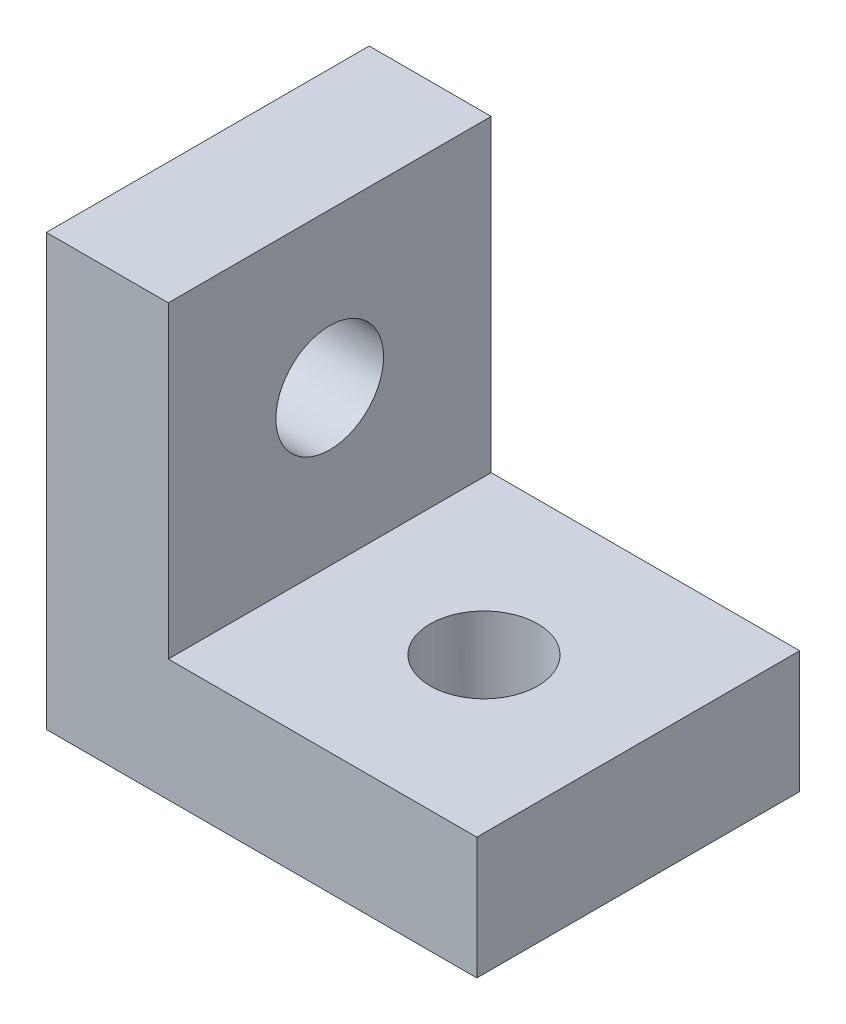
ISO-10303-21;
HEADER;
FILE_DESCRIPTION(('STEP AP214'),'2;1');
FILE_NAME('part.step','',(''),(''),'','','');
FILE_SCHEMA(('AUTOMOTIVE_DESIGN { 1 0 10303 214 1 1 1 1 }'));
ENDSEC;
DATA;
#1=APPLICATION_CONTEXT('core data for automotive mechanical design processes');
#2=APPLICATION_PROTOCOL_DEFINITION('international standard','automotive_design',2000,#1);
#3=PRODUCT_CONTEXT('',#1,'mechanical');
#4=PRODUCT('Part','Part','',(#3));
#5=PRODUCT_RELATED_PRODUCT_CATEGORY('part','',(#4));
#6=PRODUCT_DEFINITION_FORMATION('','',#4);
#7=PRODUCT_DEFINITION_CONTEXT('part definition',#1,'design');
#8=PRODUCT_DEFINITION('design','',#6,#7);
#9=PRODUCT_DEFINITION_SHAPE('','',#8);
#10=(LENGTH_UNIT() NAMED_UNIT(*) SI_UNIT(.MILLI.,.METRE.));
#11=(NAMED_UNIT(*) PLANE_ANGLE_UNIT() SI_UNIT($,.RADIAN.));
#12=(NAMED_UNIT(*) SI_UNIT($,.STERADIAN.) SOLID_ANGLE_UNIT());
#13=UNCERTAINTY_MEASURE_WITH_UNIT(LENGTH_MEASURE(1.E-05),#10,'distance_accuracy_value','');
#14=(GEOMETRIC_REPRESENTATION_CONTEXT(3) GLOBAL_UNCERTAINTY_ASSIGNED_CONTEXT((#13)) GLOBAL_UNIT_ASSIGNED_CONTEXT((#10,
#11,#12)) REPRESENTATION_CONTEXT('',''));
#15=CARTESIAN_POINT('',(0.,0.,0.));
#16=DIRECTION('',(0.,0.,1.));
#17=DIRECTION('',(1.,0.,0.));
#18=AXIS2_PLACEMENT_3D('',#15,#16,#17);
#19=CARTESIAN_POINT('',(31.75,92.075,-20.6374999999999));
#20=DIRECTION('',(1.,0.,0.));
#21=DIRECTION('',(0.,0.,-1.));
#22=AXIS2_PLACEMENT_3D('',#19,#20,#21);
#23=PLANE('',#22);
#24=CARTESIAN_POINT('',(31.75,64.7700000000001,-49.2125000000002));
#25=DIRECTION('',(1.,0.,0.));
#26=DIRECTION('',(0.,0.,-1.));
#27=AXIS2_PLACEMENT_3D('',#24,#25,#26);
#28=CIRCLE('',#27,9.52500000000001);
#29=CARTESIAN_POINT('',(31.75,64.7700000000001,-58.7375000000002));
#30=VERTEX_POINT('',#29);
#31=EDGE_CURVE('E167',#30,#30,#28,.T.);
#32=ORIENTED_EDGE('',*,*,#31,.T.);
#33=EDGE_LOOP('',(#32));
#34=FACE_BOUND('',#33,.T.);
#35=DIRECTION('',(0.,-1.,0.));
#36=VECTOR('',#35,1.);
#37=CARTESIAN_POINT('',(31.75,92.075,-77.7874999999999));
#38=LINE('',#37,#36);
#39=CARTESIAN_POINT('',(31.75,92.075,-77.7874999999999));
#40=VERTEX_POINT('',#39);
#41=CARTESIAN_POINT('',(31.75,15.875,-77.7874999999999));
#42=VERTEX_POINT('',#41);
#43=EDGE_CURVE('E89',#40,#42,#38,.T.);
#44=ORIENTED_EDGE('',*,*,#43,.T.);
#45=DIRECTION('',(0.,0.,-1.));
#46=VECTOR('',#45,1.);
#47=CARTESIAN_POINT('',(31.75,15.875,-20.6374999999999));
#48=LINE('',#47,#46);
#49=CARTESIAN_POINT('',(31.75,15.875,-20.6374999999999));
#50=VERTEX_POINT('',#49);
#51=EDGE_CURVE('E11',#50,#42,#48,.T.);
#52=ORIENTED_EDGE('',*,*,#51,.F.);
#53=DIRECTION('',(0.,-1.,0.));
#54=VECTOR('',#53,1.);
#55=CARTESIAN_POINT('',(31.75,92.075,-20.6374999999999));
#56=LINE('',#55,#54);
#57=CARTESIAN_POINT('',(31.75,92.075,-20.6374999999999));
#58=VERTEX_POINT('',#57);
#59=EDGE_CURVE('E117',#58,#50,#56,.T.);
#60=ORIENTED_EDGE('',*,*,#59,.F.);
#61=DIRECTION('',(0.,0.,-1.));
#62=VECTOR('',#61,1.);
#63=CARTESIAN_POINT('',(31.75,92.075,-20.6374999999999));
#64=LINE('',#63,#62);
#65=EDGE_CURVE('E102',#58,#40,#64,.T.);
#66=ORIENTED_EDGE('',*,*,#65,.T.);
#67=EDGE_LOOP('',(#44,#52,#60,#66));
#68=FACE_BOUND('',#67,.T.);
#69=ADVANCED_FACE('F31',(#34,#68),#23,.F.);
#70=CARTESIAN_POINT('',(31.75,15.875,-20.6374999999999));
#71=DIRECTION('',(0.,1.,0.));
#72=DIRECTION('',(0.,0.,1.));
#73=AXIS2_PLACEMENT_3D('',#70,#71,#72);
#74=PLANE('',#73);
#75=CARTESIAN_POINT('',(80.645,15.875,-49.2125000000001));
#76=DIRECTION('',(0.,1.,0.));
#77=DIRECTION('',(0.,0.,1.));
#78=AXIS2_PLACEMENT_3D('',#75,#76,#77);
#79=CIRCLE('',#78,9.52500000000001);
#80=CARTESIAN_POINT('',(80.645,15.875,-39.6875000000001));
#81=VERTEX_POINT('',#80);
#82=EDGE_CURVE('E106',#81,#81,#79,.T.);
#83=ORIENTED_EDGE('',*,*,#82,.T.);
#84=EDGE_LOOP('',(#83));
#85=FACE_BOUND('',#84,.T.);
#86=DIRECTION('',(1.,0.,0.));
#87=VECTOR('',#86,1.);
#88=CARTESIAN_POINT('',(31.75,15.875,-77.7874999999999));
#89=LINE('',#88,#87);
#90=CARTESIAN_POINT('',(107.95,15.875,-77.7874999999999));
#91=VERTEX_POINT('',#90);
#92=EDGE_CURVE('E85',#42,#91,#89,.T.);
#93=ORIENTED_EDGE('',*,*,#92,.T.);
#94=DIRECTION('',(0.,0.,-1.));
#95=VECTOR('',#94,1.);
#96=CARTESIAN_POINT('',(107.95,15.875,-20.6374999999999));
#97=LINE('',#96,#95);
#98=CARTESIAN_POINT('',(107.95,15.875,-20.6374999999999));
#99=VERTEX_POINT('',#98);
#100=EDGE_CURVE('E39',#99,#91,#97,.T.);
#101=ORIENTED_EDGE('',*,*,#100,.F.);
#102=DIRECTION('',(1.,0.,0.));
#103=VECTOR('',#102,1.);
#104=CARTESIAN_POINT('',(31.75,15.875,-20.6374999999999));
#105=LINE('',#104,#103);
#106=EDGE_CURVE('E98',#50,#99,#105,.T.);
#107=ORIENTED_EDGE('',*,*,#106,.F.);
#108=ORIENTED_EDGE('',*,*,#51,.T.);
#109=EDGE_LOOP('',(#93,#101,#107,#108));
#110=FACE_BOUND('',#109,.T.);
#111=ADVANCED_FACE('F97',(#85,#110),#74,.F.);
#112=CARTESIAN_POINT('',(107.95,15.875,-20.6374999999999));
#113=DIRECTION('',(-1.,0.,0.));
#114=DIRECTION('',(0.,0.,1.));
#115=AXIS2_PLACEMENT_3D('',#112,#113,#114);
#116=PLANE('',#115);
#117=DIRECTION('',(0.,1.,0.));
#118=VECTOR('',#117,1.);
#119=CARTESIAN_POINT('',(107.95,15.875,-77.7874999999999));
#120=LINE('',#119,#118);
#121=CARTESIAN_POINT('',(107.95,37.465,-77.7874999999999));
#122=VERTEX_POINT('',#121);
#123=EDGE_CURVE('E91',#91,#122,#120,.T.);
#124=ORIENTED_EDGE('',*,*,#123,.T.);
#125=DIRECTION('',(0.,0.,-1.));
#126=VECTOR('',#125,1.);
#127=CARTESIAN_POINT('',(107.95,37.465,-20.6374999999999));
#128=LINE('',#127,#126);
#129=CARTESIAN_POINT('',(107.95,37.465,-20.6374999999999));
#130=VERTEX_POINT('',#129);
#131=EDGE_CURVE('E133',#130,#122,#128,.T.);
#132=ORIENTED_EDGE('',*,*,#131,.F.);
#133=DIRECTION('',(0.,1.,0.));
#134=VECTOR('',#133,1.);
#135=CARTESIAN_POINT('',(107.95,15.875,-20.6374999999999));
#136=LINE('',#135,#134);
#137=EDGE_CURVE('E120',#99,#130,#136,.T.);
#138=ORIENTED_EDGE('',*,*,#137,.F.);
#139=ORIENTED_EDGE('',*,*,#100,.T.);
#140=EDGE_LOOP('',(#124,#132,#138,#139));
#141=FACE_BOUND('',#140,.T.);
#142=ADVANCED_FACE('F138',(#141),#116,.F.);
#143=CARTESIAN_POINT('',(107.95,37.465,-20.6374999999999));
#144=DIRECTION('',(0.,-1.,0.));
#145=DIRECTION('',(0.,0.,-1.));
#146=AXIS2_PLACEMENT_3D('',#143,#144,#145);
#147=PLANE('',#146);
#148=CARTESIAN_POINT('',(80.645,37.465,-49.2125000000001));
#149=DIRECTION('',(0.,-1.,0.));
#150=DIRECTION('',(0.,0.,-1.));
#151=AXIS2_PLACEMENT_3D('',#148,#149,#150);
#152=CIRCLE('',#151,9.52500000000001);
#153=CARTESIAN_POINT('',(80.645,37.465,-58.7375000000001));
#154=VERTEX_POINT('',#153);
#155=EDGE_CURVE('E103',#154,#154,#152,.T.);
#156=ORIENTED_EDGE('',*,*,#155,.T.);
#157=EDGE_LOOP('',(#156));
#158=FACE_BOUND('',#157,.T.);
#159=DIRECTION('',(-1.,0.,0.));
#160=VECTOR('',#159,1.);
#161=CARTESIAN_POINT('',(107.95,37.465,-77.7874999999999));
#162=LINE('',#161,#160);
#163=CARTESIAN_POINT('',(53.34,37.465,-77.7874999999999));
#164=VERTEX_POINT('',#163);
#165=EDGE_CURVE('E111',#122,#164,#162,.T.);
#166=ORIENTED_EDGE('',*,*,#165,.T.);
#167=DIRECTION('',(0.,0.,-1.));
#168=VECTOR('',#167,1.);
#169=CARTESIAN_POINT('',(53.34,37.465,-20.6374999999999));
#170=LINE('',#169,#168);
#171=CARTESIAN_POINT('',(53.34,37.465,-20.6374999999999));
#172=VERTEX_POINT('',#171);
#173=EDGE_CURVE('E130',#172,#164,#170,.T.);
#174=ORIENTED_EDGE('',*,*,#173,.F.);
#175=DIRECTION('',(-1.,0.,0.));
#176=VECTOR('',#175,1.);
#177=CARTESIAN_POINT('',(107.95,37.465,-20.6374999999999));
#178=LINE('',#177,#176);
#179=EDGE_CURVE('E122',#130,#172,#178,.T.);
#180=ORIENTED_EDGE('',*,*,#179,.F.);
#181=ORIENTED_EDGE('',*,*,#131,.T.);
#182=EDGE_LOOP('',(#166,#174,#180,#181));
#183=FACE_BOUND('',#182,.T.);
#184=ADVANCED_FACE('F144',(#158,#183),#147,.F.);
#185=CARTESIAN_POINT('',(53.34,37.465,-20.6374999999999));
#186=DIRECTION('',(-1.,0.,0.));
#187=DIRECTION('',(0.,0.,1.));
#188=AXIS2_PLACEMENT_3D('',#185,#186,#187);
#189=PLANE('',#188);
#190=CARTESIAN_POINT('',(53.34,64.7700000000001,-49.2125000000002));
#191=DIRECTION('',(-1.,0.,0.));
#192=DIRECTION('',(0.,0.,1.));
#193=AXIS2_PLACEMENT_3D('',#190,#191,#192);
#194=CIRCLE('',#193,9.52500000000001);
#195=CARTESIAN_POINT('',(53.34,64.7700000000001,-39.6875000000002));
#196=VERTEX_POINT('',#195);
#197=EDGE_CURVE('E34',#196,#196,#194,.T.);
#198=ORIENTED_EDGE('',*,*,#197,.T.);
#199=EDGE_LOOP('',(#198));
#200=FACE_BOUND('',#199,.T.);
#201=DIRECTION('',(0.,1.,0.));
#202=VECTOR('',#201,1.);
#203=CARTESIAN_POINT('',(53.34,37.465,-77.7874999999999));
#204=LINE('',#203,#202);
#205=CARTESIAN_POINT('',(53.34,92.075,-77.7874999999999));
#206=VERTEX_POINT('',#205);
#207=EDGE_CURVE('E113',#164,#206,#204,.T.);
#208=ORIENTED_EDGE('',*,*,#207,.T.);
#209=DIRECTION('',(0.,0.,-1.));
#210=VECTOR('',#209,1.);
#211=CARTESIAN_POINT('',(53.34,92.075,-20.6374999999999));
#212=LINE('',#211,#210);
#213=CARTESIAN_POINT('',(53.34,92.075,-20.6374999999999));
#214=VERTEX_POINT('',#213);
#215=EDGE_CURVE('E127',#214,#206,#212,.T.);
#216=ORIENTED_EDGE('',*,*,#215,.F.);
#217=DIRECTION('',(0.,1.,0.));
#218=VECTOR('',#217,1.);
#219=CARTESIAN_POINT('',(53.34,37.465,-20.6374999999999));
#220=LINE('',#219,#218);
#221=EDGE_CURVE('E52',#172,#214,#220,.T.);
#222=ORIENTED_EDGE('',*,*,#221,.F.);
#223=ORIENTED_EDGE('',*,*,#173,.T.);
#224=EDGE_LOOP('',(#208,#216,#222,#223));
#225=FACE_BOUND('',#224,.T.);
#226=ADVANCED_FACE('F147',(#200,#225),#189,.F.);
#227=CARTESIAN_POINT('',(53.34,92.075,-20.6374999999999));
#228=DIRECTION('',(0.,-1.,0.));
#229=DIRECTION('',(0.,0.,-1.));
#230=AXIS2_PLACEMENT_3D('',#227,#228,#229);
#231=PLANE('',#230);
#232=DIRECTION('',(-1.,0.,0.));
#233=VECTOR('',#232,1.);
#234=CARTESIAN_POINT('',(53.34,92.075,-77.7874999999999));
#235=LINE('',#234,#233);
#236=EDGE_CURVE('E115',#206,#40,#235,.T.);
#237=ORIENTED_EDGE('',*,*,#236,.T.);
#238=ORIENTED_EDGE('',*,*,#65,.F.);
#239=DIRECTION('',(-1.,0.,0.));
#240=VECTOR('',#239,1.);
#241=CARTESIAN_POINT('',(53.34,92.075,-20.6374999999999));
#242=LINE('',#241,#240);
#243=EDGE_CURVE('E47',#214,#58,#242,.T.);
#244=ORIENTED_EDGE('',*,*,#243,.F.);
#245=ORIENTED_EDGE('',*,*,#215,.T.);
#246=EDGE_LOOP('',(#237,#238,#244,#245));
#247=FACE_BOUND('',#246,.T.);
#248=ADVANCED_FACE('F149',(#247),#231,.F.);
#249=CARTESIAN_POINT('',(31.75,15.875,-20.6374999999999));
#250=DIRECTION('',(0.,0.,1.));
#251=DIRECTION('',(1.,0.,0.));
#252=AXIS2_PLACEMENT_3D('',#249,#250,#251);
#253=PLANE('',#252);
#254=ORIENTED_EDGE('',*,*,#59,.T.);
#255=ORIENTED_EDGE('',*,*,#106,.T.);
#256=ORIENTED_EDGE('',*,*,#137,.T.);
#257=ORIENTED_EDGE('',*,*,#179,.T.);
#258=ORIENTED_EDGE('',*,*,#221,.T.);
#259=ORIENTED_EDGE('',*,*,#243,.T.);
#260=EDGE_LOOP('',(#254,#255,#256,#257,#258,#259));
#261=FACE_BOUND('',#260,.T.);
#262=ADVANCED_FACE('F141',(#261),#253,.T.);
#263=CARTESIAN_POINT('',(31.75,15.875,-77.7874999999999));
#264=DIRECTION('',(0.,0.,1.));
#265=DIRECTION('',(1.,0.,0.));
#266=AXIS2_PLACEMENT_3D('',#263,#264,#265);
#267=PLANE('',#266);
#268=ORIENTED_EDGE('',*,*,#43,.F.);
#269=ORIENTED_EDGE('',*,*,#236,.F.);
#270=ORIENTED_EDGE('',*,*,#207,.F.);
#271=ORIENTED_EDGE('',*,*,#165,.F.);
#272=ORIENTED_EDGE('',*,*,#123,.F.);
#273=ORIENTED_EDGE('',*,*,#92,.F.);
#274=EDGE_LOOP('',(#268,#269,#270,#271,#272,#273));
#275=FACE_BOUND('',#274,.T.);
#276=ADVANCED_FACE('F86',(#275),#267,.F.);
#277=CARTESIAN_POINT('',(80.645,15.875,-49.2125000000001));
#278=DIRECTION('',(0.,1.,0.));
#279=DIRECTION('',(0.,0.,1.));
#280=AXIS2_PLACEMENT_3D('',#277,#278,#279);
#281=CYLINDRICAL_SURFACE('',#280,9.52500000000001);
#282=ORIENTED_EDGE('',*,*,#82,.F.);
#283=EDGE_LOOP('',(#282));
#284=FACE_BOUND('',#283,.T.);
#285=ORIENTED_EDGE('',*,*,#155,.F.);
#286=EDGE_LOOP('',(#285));
#287=FACE_BOUND('',#286,.T.);
#288=ADVANCED_FACE('F174',(#284,#287),#281,.F.);
#289=CARTESIAN_POINT('',(31.75,64.7700000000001,-49.2125000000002));
#290=DIRECTION('',(1.,0.,0.));
#291=DIRECTION('',(0.,0.,-1.));
#292=AXIS2_PLACEMENT_3D('',#289,#290,#291);
#293=CYLINDRICAL_SURFACE('',#292,9.52500000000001);
#294=ORIENTED_EDGE('',*,*,#31,.F.);
#295=EDGE_LOOP('',(#294));
#296=FACE_BOUND('',#295,.T.);
#297=ORIENTED_EDGE('',*,*,#197,.F.);
#298=EDGE_LOOP('',(#297));
#299=FACE_BOUND('',#298,.T.);
#300=ADVANCED_FACE('F177',(#296,#299),#293,.F.);
#301=CLOSED_SHELL('',(#69,#111,#142,#184,#226,#248,#262,#276,#288,#300));
#302=MANIFOLD_SOLID_BREP('B2',#301);
#303=ADVANCED_BREP_SHAPE_REPRESENTATION('',(#18,#302),#14);
#304=SHAPE_DEFINITION_REPRESENTATION(#9,#303);
ENDSEC;
END-ISO-10303-21;
